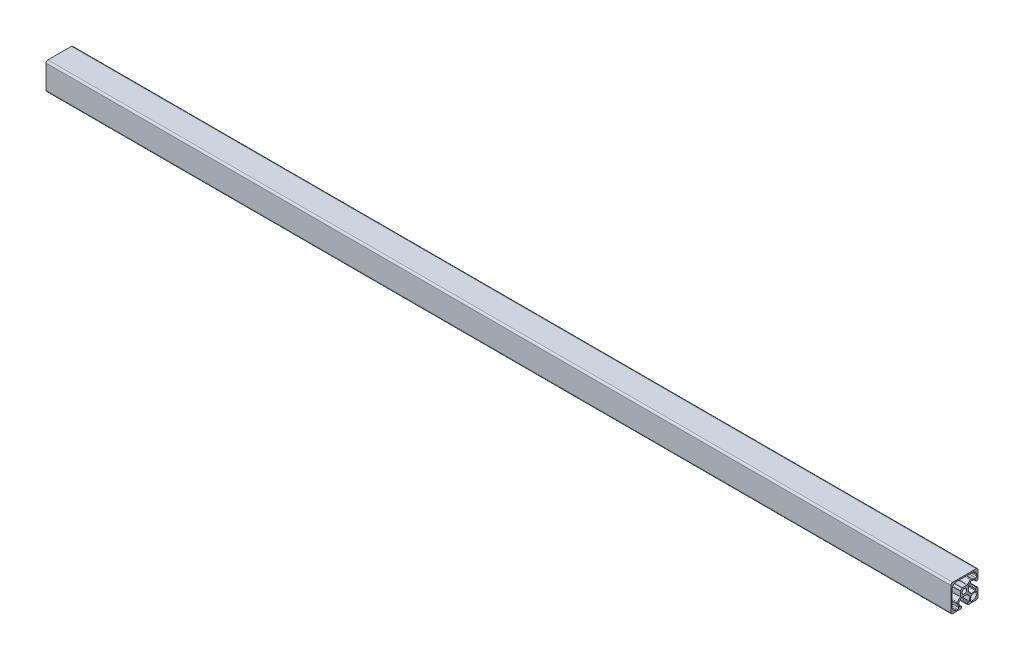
from build123d import *

# Parameters (mm, degrees)
SKETCH_1_R      = 2.55
EXTRUDE_1_DEPTH = 1000


with BuildPart() as part:
    # Sketch 1 → Extrude 1 (new body)
    with BuildSketch(Plane(origin=(0, 0, 0), x_dir=(0, 0, -1), z_dir=(1, 0, 0))):
        with BuildLine():
            Line((-15, -13), (-15, 13))
            ThreePointArc((-15, 13), (-14.414213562, 14.414213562), (-13, 15))
            Line((-13, 15), (13, 15))
            ThreePointArc((13, 15), (14.414213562, 14.414213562), (15, 13))
            Line((15, 13), (15, 4.35))
            ThreePointArc((15, 4.35), (14.648528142, 3.50147186), (13.800000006, 3.149999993))
            Line((13.800000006, 3.149999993), (13.250000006, 3.149999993))
            ThreePointArc((13.250000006, 3.149999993), (12.71966992, 3.369669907), (12.500000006, 3.899999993))
            Line((12.500000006, 3.899999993), (12.500000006, 4.874840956))
            ThreePointArc((12.500000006, 4.874840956), (12.383022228, 5.196234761), (12.086824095, 5.367244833))
            Line((12.086824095, 5.367244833), (8.089371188, 6.072103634))
            ThreePointArc((8.089371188, 6.072103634), (7.615017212, 6.041012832), (7.208616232, 5.794402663))
            Line((7.208616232, 5.794402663), (4.792893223, 3.378679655))
            ThreePointArc((4.792893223, 3.378679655), (4.576120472, 3.054256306), (4.500000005, 2.671572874))
            Line((4.500000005, 2.671572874), (4.500000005, -2.671572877))
            ThreePointArc((4.500000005, -2.671572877), (4.576120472, -3.05425631), (4.792893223, -3.378679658))
            Line((4.792893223, -3.378679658), (7.208616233, -5.794402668))
            ThreePointArc((7.208616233, -5.794402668), (7.615017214, -6.041012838), (8.089371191, -6.07210364))
            Line((8.089371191, -6.07210364), (12.086824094, -5.367244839))
            ThreePointArc((12.086824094, -5.367244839), (12.383022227, -5.196234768), (12.500000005, -4.874840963))
            Line((12.500000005, -4.874840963), (12.500000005, -3.9))
            ThreePointArc((12.500000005, -3.9), (12.719669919, -3.369669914), (13.250000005, -3.15))
            Line((13.250000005, -3.15), (13.800000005, -3.15))
            ThreePointArc((13.800000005, -3.15), (14.648528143, -3.501471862), (15.000000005, -4.35))
            Line((15.000000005, -4.35), (15.000000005, -13))
            ThreePointArc((15.000000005, -13), (14.414213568, -14.414213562), (13.000000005, -15))
            Line((13.000000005, -15), (4.350000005, -15))
            ThreePointArc((4.350000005, -15), (3.501471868, -14.648528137), (3.150000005, -13.8))
            Line((3.150000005, -13.8), (3.150000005, -13.25))
            ThreePointArc((3.150000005, -13.25), (3.369669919, -12.719669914), (3.900000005, -12.5))
            Line((3.900000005, -12.5), (4.874840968, -12.5))
            ThreePointArc((4.874840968, -12.5), (5.196234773, -12.383022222), (5.367244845, -12.086824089))
            Line((5.367244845, -12.086824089), (6.072103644, -8.089371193))
            ThreePointArc((6.072103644, -8.089371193), (6.041012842, -7.615017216), (5.794402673, -7.208616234))
            Line((5.794402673, -7.208616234), (3.378679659, -4.79289322))
            ThreePointArc((3.378679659, -4.79289322), (3.05425631, -4.576120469), (2.671572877, -4.500000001))
            Line((2.671572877, -4.500000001), (-2.671572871, -4.500000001))
            ThreePointArc((-2.671572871, -4.500000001), (-3.054256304, -4.576120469), (-3.378679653, -4.792893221))
            Line((-3.378679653, -4.792893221), (-5.794402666, -7.208616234))
            ThreePointArc((-5.794402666, -7.208616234), (-6.041012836, -7.615017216), (-6.072103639, -8.089371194))
            Line((-6.072103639, -8.089371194), (-5.367244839, -12.086824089))
            ThreePointArc((-5.367244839, -12.086824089), (-5.196234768, -12.383022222), (-4.874840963, -12.5))
            Line((-4.874840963, -12.5), (-3.9, -12.5))
            ThreePointArc((-3.9, -12.5), (-3.369661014, -12.719678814), (-3.15, -13.250025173))
            Line((-3.15, -13.250025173), (-3.15, -13.8))
            ThreePointArc((-3.15, -13.8), (-3.501471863, -14.648528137), (-4.35, -15))
            Line((-4.35, -15), (-13, -15))
            ThreePointArc((-13, -15), (-14.414213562, -14.414213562), (-15, -13))
        make_face()
        Circle(SKETCH_1_R, mode=Mode.SUBTRACT)
        with BuildLine():
            Line((-13.5, -9.559249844), (-13.5, 9.559249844))
            ThreePointArc((-13.5, 9.559249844), (-13.483593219, 9.73965045), (-13.434911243, 9.91413147))
            ThreePointArc((-13.434911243, 9.91413147), (-12.052138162, 12.052138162), (-9.91413147, 13.434911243))
            ThreePointArc((-9.91413147, 13.434911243), (-9.73965045, 13.483593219), (-9.559249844, 13.5))
            Line((-9.559249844, 13.5), (9.559249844, 13.5))
            ThreePointArc((9.559249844, 13.5), (9.73965045, 13.483593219), (9.91413147, 13.434911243))
            ThreePointArc((9.91413147, 13.434911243), (12.333550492, 11.750931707), (13.674358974, 9.125744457))
            ThreePointArc((13.674358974, 9.125744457), (13.693569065, 9.013973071), (13.7, 8.900745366))
            Line((13.7, 8.900745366), (13.7, 7.493063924))
            ThreePointArc((13.7, 7.493063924), (13.342787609, 6.72701948), (12.526351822, 6.508256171))
            Line((12.526351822, 6.508256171), (9.479055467, 7.045576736))
            ThreePointArc((9.479055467, 7.045576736), (8.614754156, 7.338967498), (7.87867965, 7.878679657))
            ThreePointArc((7.87867965, 7.878679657), (7.171572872, 8.171572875), (6.464466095, 7.878679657))
            Line((6.464466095, 7.878679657), (3.378679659, 4.792893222))
            ThreePointArc((3.378679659, 4.792893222), (3.05425631, 4.576120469), (2.671572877, 4.500000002))
            Line((2.671572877, 4.500000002), (-2.085786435, 4.500000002))
            ThreePointArc((-2.085786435, 4.500000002), (-2.468469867, 4.423879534), (-2.792893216, 4.207106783))
            Line((-2.792893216, 4.207106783), (-4.207106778, 2.79289322))
            ThreePointArc((-4.207106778, 2.79289322), (-4.42387953, 2.468469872), (-4.499999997, 2.085786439))
            Line((-4.499999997, 2.085786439), (-4.499999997, -2.671572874))
            ThreePointArc((-4.499999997, -2.671572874), (-4.576120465, -3.054256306), (-4.792893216, -3.378679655))
            Line((-4.792893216, -3.378679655), (-7.878679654, -6.464466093))
            ThreePointArc((-7.878679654, -6.464466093), (-8.171572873, -7.171572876), (-7.878679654, -7.878679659))
            ThreePointArc((-7.878679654, -7.878679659), (-7.3389675, -8.614754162), (-7.045576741, -9.479055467))
            Line((-7.045576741, -9.479055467), (-6.508256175, -12.526351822))
            ThreePointArc((-6.508256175, -12.526351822), (-6.727019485, -13.34278761), (-7.493063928, -13.7))
            Line((-7.493063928, -13.7), (-8.90074537, -13.7))
            ThreePointArc((-8.90074537, -13.7), (-9.013973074, -13.693569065), (-9.125744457, -13.674358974))
            ThreePointArc((-9.125744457, -13.674358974), (-11.750931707, -12.333550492), (-13.434911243, -9.91413147))
            ThreePointArc((-13.434911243, -9.91413147), (-13.483593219, -9.73965045), (-13.5, -9.559249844))
        make_face(mode=Mode.SUBTRACT)
        with BuildLine():
            Line((13.7, -8.90074537), (13.7, -7.493063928))
            ThreePointArc((13.7, -7.493063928), (13.34278761, -6.727019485), (12.526351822, -6.508256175))
            Line((12.526351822, -6.508256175), (9.479055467, -7.045576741))
            ThreePointArc((9.479055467, -7.045576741), (7.878679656, -7.878679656), (7.045576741, -9.479055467))
            Line((7.045576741, -9.479055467), (6.508256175, -12.526351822))
            ThreePointArc((6.508256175, -12.526351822), (6.727019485, -13.34278761), (7.493063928, -13.7))
            Line((7.493063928, -13.7), (8.90074537, -13.7))
            ThreePointArc((8.90074537, -13.7), (9.013973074, -13.693569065), (9.125744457, -13.674358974))
            ThreePointArc((9.125744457, -13.674358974), (12.052138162, -12.052138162), (13.674358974, -9.125744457))
            ThreePointArc((13.674358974, -9.125744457), (13.693569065, -9.013973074), (13.7, -8.90074537))
        make_face(mode=Mode.SUBTRACT)
    extrude(amount=EXTRUDE_1_DEPTH)


solid = part.part
